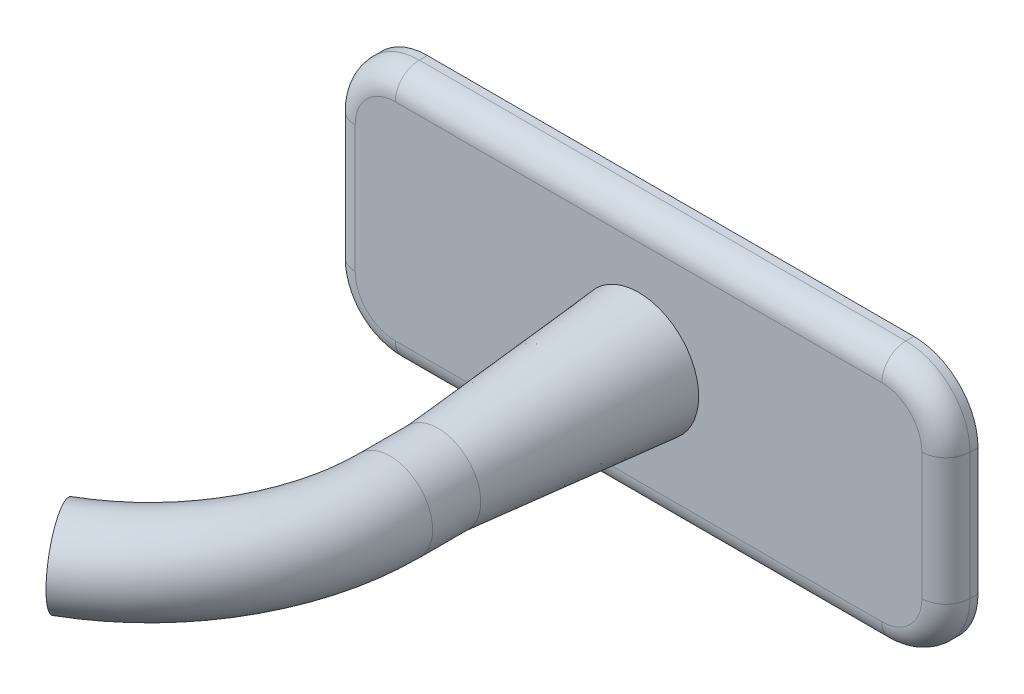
ISO-10303-21;
HEADER;
FILE_DESCRIPTION(('STEP AP214'),'2;1');
FILE_NAME('part.step','',(''),(''),'','','');
FILE_SCHEMA(('AUTOMOTIVE_DESIGN { 1 0 10303 214 1 1 1 1 }'));
ENDSEC;
DATA;
#1=APPLICATION_CONTEXT('core data for automotive mechanical design processes');
#2=APPLICATION_PROTOCOL_DEFINITION('international standard','automotive_design',2000,#1);
#3=PRODUCT_CONTEXT('',#1,'mechanical');
#4=PRODUCT('Part','Part','',(#3));
#5=PRODUCT_RELATED_PRODUCT_CATEGORY('part','',(#4));
#6=PRODUCT_DEFINITION_FORMATION('','',#4);
#7=PRODUCT_DEFINITION_CONTEXT('part definition',#1,'design');
#8=PRODUCT_DEFINITION('design','',#6,#7);
#9=PRODUCT_DEFINITION_SHAPE('','',#8);
#10=(LENGTH_UNIT() NAMED_UNIT(*) SI_UNIT(.MILLI.,.METRE.));
#11=(NAMED_UNIT(*) PLANE_ANGLE_UNIT() SI_UNIT($,.RADIAN.));
#12=(NAMED_UNIT(*) SI_UNIT($,.STERADIAN.) SOLID_ANGLE_UNIT());
#13=UNCERTAINTY_MEASURE_WITH_UNIT(LENGTH_MEASURE(1.E-05),#10,'distance_accuracy_value','');
#14=(GEOMETRIC_REPRESENTATION_CONTEXT(3) GLOBAL_UNCERTAINTY_ASSIGNED_CONTEXT((#13)) GLOBAL_UNIT_ASSIGNED_CONTEXT((#10,
#11,#12)) REPRESENTATION_CONTEXT('',''));
#15=CARTESIAN_POINT('',(0.,0.,0.));
#16=DIRECTION('',(0.,0.,1.));
#17=DIRECTION('',(1.,0.,0.));
#18=AXIS2_PLACEMENT_3D('',#15,#16,#17);
#19=CARTESIAN_POINT('',(-9.740999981,-4.04241,1.016));
#20=DIRECTION('',(0.,0.,1.));
#21=DIRECTION('',(1.,0.,0.));
#22=AXIS2_PLACEMENT_3D('',#19,#20,#21);
#23=PLANE('',#22);
#24=DIRECTION('',(0.,-1.,0.));
#25=VECTOR('',#24,1.);
#26=CARTESIAN_POINT('',(-8.978999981,-2.01041,1.016));
#27=LINE('',#26,#25);
#28=CARTESIAN_POINT('',(-8.978999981,2.01041,1.016));
#29=VERTEX_POINT('',#28);
#30=CARTESIAN_POINT('',(-8.978999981,-2.01041,1.016));
#31=VERTEX_POINT('',#30);
#32=EDGE_CURVE('E196',#29,#31,#27,.T.);
#33=ORIENTED_EDGE('',*,*,#32,.T.);
#34=CARTESIAN_POINT('',(-7.708999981,-2.01041,1.016));
#35=DIRECTION('',(0.,0.,1.));
#36=DIRECTION('',(1.,0.,0.));
#37=AXIS2_PLACEMENT_3D('',#34,#35,#36);
#38=CIRCLE('',#37,1.27);
#39=CARTESIAN_POINT('',(-7.708999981,-3.28041,1.016));
#40=VERTEX_POINT('',#39);
#41=EDGE_CURVE('E198',#31,#40,#38,.T.);
#42=ORIENTED_EDGE('',*,*,#41,.T.);
#43=DIRECTION('',(1.,0.,0.));
#44=VECTOR('',#43,1.);
#45=CARTESIAN_POINT('',(7.708999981,-3.28041,1.016));
#46=LINE('',#45,#44);
#47=CARTESIAN_POINT('',(7.708999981,-3.28041,1.016));
#48=VERTEX_POINT('',#47);
#49=EDGE_CURVE('E184',#40,#48,#46,.T.);
#50=ORIENTED_EDGE('',*,*,#49,.T.);
#51=CARTESIAN_POINT('',(7.708999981,-2.01041,1.016));
#52=DIRECTION('',(0.,0.,1.));
#53=DIRECTION('',(1.,0.,0.));
#54=AXIS2_PLACEMENT_3D('',#51,#52,#53);
#55=CIRCLE('',#54,1.27);
#56=CARTESIAN_POINT('',(8.978999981,-2.01041,1.016));
#57=VERTEX_POINT('',#56);
#58=EDGE_CURVE('E186',#48,#57,#55,.T.);
#59=ORIENTED_EDGE('',*,*,#58,.T.);
#60=DIRECTION('',(0.,1.,0.));
#61=VECTOR('',#60,1.);
#62=CARTESIAN_POINT('',(8.978999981,2.01041,1.016));
#63=LINE('',#62,#61);
#64=CARTESIAN_POINT('',(8.978999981,2.01041,1.016));
#65=VERTEX_POINT('',#64);
#66=EDGE_CURVE('E188',#57,#65,#63,.T.);
#67=ORIENTED_EDGE('',*,*,#66,.T.);
#68=CARTESIAN_POINT('',(7.708999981,2.01041,1.016));
#69=DIRECTION('',(0.,0.,1.));
#70=DIRECTION('',(1.,0.,0.));
#71=AXIS2_PLACEMENT_3D('',#68,#69,#70);
#72=CIRCLE('',#71,1.27);
#73=CARTESIAN_POINT('',(7.708999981,3.28041,1.016));
#74=VERTEX_POINT('',#73);
#75=EDGE_CURVE('E190',#65,#74,#72,.T.);
#76=ORIENTED_EDGE('',*,*,#75,.T.);
#77=DIRECTION('',(-1.,0.,0.));
#78=VECTOR('',#77,1.);
#79=CARTESIAN_POINT('',(-7.708999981,3.28041,1.016));
#80=LINE('',#79,#78);
#81=CARTESIAN_POINT('',(-7.708999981,3.28041,1.016));
#82=VERTEX_POINT('',#81);
#83=EDGE_CURVE('E192',#74,#82,#80,.T.);
#84=ORIENTED_EDGE('',*,*,#83,.T.);
#85=CARTESIAN_POINT('',(-7.708999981,2.01041,1.016));
#86=DIRECTION('',(0.,0.,1.));
#87=DIRECTION('',(1.,0.,0.));
#88=AXIS2_PLACEMENT_3D('',#85,#86,#87);
#89=CIRCLE('',#88,1.27);
#90=EDGE_CURVE('E194',#82,#29,#89,.T.);
#91=ORIENTED_EDGE('',*,*,#90,.T.);
#92=EDGE_LOOP('',(#33,#42,#50,#59,#67,#76,#84,#91));
#93=FACE_BOUND('',#92,.T.);
#94=CARTESIAN_POINT('',(0.,0.,1.016));
#95=DIRECTION('',(0.,0.,1.));
#96=DIRECTION('',(1.,0.,0.));
#97=AXIS2_PLACEMENT_3D('',#94,#95,#96);
#98=CIRCLE('',#97,1.905);
#99=CARTESIAN_POINT('',(1.905,0.,1.016));
#100=VERTEX_POINT('',#99);
#101=EDGE_CURVE('E474',#100,#100,#98,.T.);
#102=ORIENTED_EDGE('',*,*,#101,.F.);
#103=EDGE_LOOP('',(#102));
#104=FACE_BOUND('',#103,.T.);
#105=ADVANCED_FACE('F35',(#93,#104),#23,.T.);
#106=CARTESIAN_POINT('',(-9.740999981,4.04241,1.016));
#107=DIRECTION('',(1.,0.,0.));
#108=DIRECTION('',(0.,0.,-1.));
#109=AXIS2_PLACEMENT_3D('',#106,#107,#108);
#110=PLANE('',#109);
#111=DIRECTION('',(0.,0.,-1.));
#112=VECTOR('',#111,1.);
#113=CARTESIAN_POINT('',(-9.740999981,-2.01041,1.016));
#114=LINE('',#113,#112);
#115=CARTESIAN_POINT('',(-9.740999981,-2.01041,0.));
#116=VERTEX_POINT('',#115);
#117=CARTESIAN_POINT('',(-9.740999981,-2.01041,0.254));
#118=VERTEX_POINT('',#117);
#119=EDGE_CURVE('E138',#116,#118,#114,.F.);
#120=ORIENTED_EDGE('',*,*,#119,.T.);
#121=DIRECTION('',(0.,-1.,0.));
#122=VECTOR('',#121,1.);
#123=CARTESIAN_POINT('',(-9.740999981,2.01041,0.254));
#124=LINE('',#123,#122);
#125=CARTESIAN_POINT('',(-9.740999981,2.01041,0.254));
#126=VERTEX_POINT('',#125);
#127=EDGE_CURVE('E134',#118,#126,#124,.F.);
#128=ORIENTED_EDGE('',*,*,#127,.T.);
#129=DIRECTION('',(0.,0.,-1.));
#130=VECTOR('',#129,1.);
#131=CARTESIAN_POINT('',(-9.740999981,2.01041,1.016));
#132=LINE('',#131,#130);
#133=CARTESIAN_POINT('',(-9.740999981,2.01041,0.));
#134=VERTEX_POINT('',#133);
#135=EDGE_CURVE('E126',#126,#134,#132,.T.);
#136=ORIENTED_EDGE('',*,*,#135,.T.);
#137=DIRECTION('',(0.,-1.,0.));
#138=VECTOR('',#137,1.);
#139=CARTESIAN_POINT('',(-9.740999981,4.04241,0.));
#140=LINE('',#139,#138);
#141=EDGE_CURVE('E131',#134,#116,#140,.T.);
#142=ORIENTED_EDGE('',*,*,#141,.T.);
#143=EDGE_LOOP('',(#120,#128,#136,#142));
#144=FACE_BOUND('',#143,.T.);
#145=ADVANCED_FACE('F129',(#144),#110,.F.);
#146=CARTESIAN_POINT('',(-9.740999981,-4.04241,1.016));
#147=DIRECTION('',(0.,1.,0.));
#148=DIRECTION('',(0.,0.,1.));
#149=AXIS2_PLACEMENT_3D('',#146,#147,#148);
#150=PLANE('',#149);
#151=DIRECTION('',(0.,0.,-1.));
#152=VECTOR('',#151,1.);
#153=CARTESIAN_POINT('',(7.708999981,-4.04241,1.016));
#154=LINE('',#153,#152);
#155=CARTESIAN_POINT('',(7.708999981,-4.04241,0.));
#156=VERTEX_POINT('',#155);
#157=CARTESIAN_POINT('',(7.708999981,-4.04241,0.254));
#158=VERTEX_POINT('',#157);
#159=EDGE_CURVE('E176',#156,#158,#154,.F.);
#160=ORIENTED_EDGE('',*,*,#159,.T.);
#161=DIRECTION('',(1.,0.,0.));
#162=VECTOR('',#161,1.);
#163=CARTESIAN_POINT('',(-7.708999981,-4.04241,0.254));
#164=LINE('',#163,#162);
#165=CARTESIAN_POINT('',(-7.708999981,-4.04241,0.254));
#166=VERTEX_POINT('',#165);
#167=EDGE_CURVE('E11',#158,#166,#164,.F.);
#168=ORIENTED_EDGE('',*,*,#167,.T.);
#169=DIRECTION('',(0.,0.,-1.));
#170=VECTOR('',#169,1.);
#171=CARTESIAN_POINT('',(-7.708999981,-4.04241,1.016));
#172=LINE('',#171,#170);
#173=CARTESIAN_POINT('',(-7.708999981,-4.04241,0.));
#174=VERTEX_POINT('',#173);
#175=EDGE_CURVE('E178',#166,#174,#172,.T.);
#176=ORIENTED_EDGE('',*,*,#175,.T.);
#177=DIRECTION('',(1.,0.,0.));
#178=VECTOR('',#177,1.);
#179=CARTESIAN_POINT('',(-9.740999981,-4.04241,0.));
#180=LINE('',#179,#178);
#181=EDGE_CURVE('E154',#174,#156,#180,.T.);
#182=ORIENTED_EDGE('',*,*,#181,.T.);
#183=EDGE_LOOP('',(#160,#168,#176,#182));
#184=FACE_BOUND('',#183,.T.);
#185=ADVANCED_FACE('F253',(#184),#150,.F.);
#186=CARTESIAN_POINT('',(9.740999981,4.04241,1.016));
#187=DIRECTION('',(-1.,0.,0.));
#188=DIRECTION('',(0.,-1.,0.));
#189=AXIS2_PLACEMENT_3D('',#186,#187,#188);
#190=PLANE('',#189);
#191=DIRECTION('',(0.,0.,-1.));
#192=VECTOR('',#191,1.);
#193=CARTESIAN_POINT('',(9.740999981,2.01041,1.016));
#194=LINE('',#193,#192);
#195=CARTESIAN_POINT('',(9.740999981,2.01041,0.));
#196=VERTEX_POINT('',#195);
#197=CARTESIAN_POINT('',(9.740999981,2.01041,0.254));
#198=VERTEX_POINT('',#197);
#199=EDGE_CURVE('E182',#196,#198,#194,.F.);
#200=ORIENTED_EDGE('',*,*,#199,.T.);
#201=DIRECTION('',(0.,1.,0.));
#202=VECTOR('',#201,1.);
#203=CARTESIAN_POINT('',(9.740999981,-2.01041,0.254));
#204=LINE('',#203,#202);
#205=CARTESIAN_POINT('',(9.740999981,-2.01041,0.254));
#206=VERTEX_POINT('',#205);
#207=EDGE_CURVE('E59',#198,#206,#204,.F.);
#208=ORIENTED_EDGE('',*,*,#207,.T.);
#209=DIRECTION('',(0.,0.,-1.));
#210=VECTOR('',#209,1.);
#211=CARTESIAN_POINT('',(9.740999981,-2.01041,1.016));
#212=LINE('',#211,#210);
#213=CARTESIAN_POINT('',(9.740999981,-2.01041,0.));
#214=VERTEX_POINT('',#213);
#215=EDGE_CURVE('E180',#206,#214,#212,.T.);
#216=ORIENTED_EDGE('',*,*,#215,.T.);
#217=DIRECTION('',(0.,1.,0.));
#218=VECTOR('',#217,1.);
#219=CARTESIAN_POINT('',(9.740999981,4.04241,0.));
#220=LINE('',#219,#218);
#221=EDGE_CURVE('E157',#214,#196,#220,.T.);
#222=ORIENTED_EDGE('',*,*,#221,.T.);
#223=EDGE_LOOP('',(#200,#208,#216,#222));
#224=FACE_BOUND('',#223,.T.);
#225=ADVANCED_FACE('F295',(#224),#190,.F.);
#226=CARTESIAN_POINT('',(-9.740999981,4.04241,1.016));
#227=DIRECTION('',(0.,-1.,0.));
#228=DIRECTION('',(0.,0.,-1.));
#229=AXIS2_PLACEMENT_3D('',#226,#227,#228);
#230=PLANE('',#229);
#231=DIRECTION('',(0.,0.,-1.));
#232=VECTOR('',#231,1.);
#233=CARTESIAN_POINT('',(-7.708999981,4.04241,1.016));
#234=LINE('',#233,#232);
#235=CARTESIAN_POINT('',(-7.708999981,4.04241,0.));
#236=VERTEX_POINT('',#235);
#237=CARTESIAN_POINT('',(-7.708999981,4.04241,0.254));
#238=VERTEX_POINT('',#237);
#239=EDGE_CURVE('E144',#236,#238,#234,.F.);
#240=ORIENTED_EDGE('',*,*,#239,.T.);
#241=DIRECTION('',(-1.,0.,0.));
#242=VECTOR('',#241,1.);
#243=CARTESIAN_POINT('',(7.708999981,4.04241,0.254));
#244=LINE('',#243,#242);
#245=CARTESIAN_POINT('',(7.708999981,4.04241,0.254));
#246=VERTEX_POINT('',#245);
#247=EDGE_CURVE('E207',#238,#246,#244,.F.);
#248=ORIENTED_EDGE('',*,*,#247,.T.);
#249=DIRECTION('',(0.,0.,-1.));
#250=VECTOR('',#249,1.);
#251=CARTESIAN_POINT('',(7.708999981,4.04241,1.016));
#252=LINE('',#251,#250);
#253=CARTESIAN_POINT('',(7.708999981,4.04241,0.));
#254=VERTEX_POINT('',#253);
#255=EDGE_CURVE('E148',#246,#254,#252,.T.);
#256=ORIENTED_EDGE('',*,*,#255,.T.);
#257=DIRECTION('',(-1.,0.,0.));
#258=VECTOR('',#257,1.);
#259=CARTESIAN_POINT('',(-9.740999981,4.04241,0.));
#260=LINE('',#259,#258);
#261=EDGE_CURVE('E167',#254,#236,#260,.T.);
#262=ORIENTED_EDGE('',*,*,#261,.T.);
#263=EDGE_LOOP('',(#240,#248,#256,#262));
#264=FACE_BOUND('',#263,.T.);
#265=ADVANCED_FACE('F270',(#264),#230,.F.);
#266=CARTESIAN_POINT('',(-9.740999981,-4.04241,0.));
#267=DIRECTION('',(0.,0.,1.));
#268=DIRECTION('',(1.,0.,0.));
#269=AXIS2_PLACEMENT_3D('',#266,#267,#268);
#270=PLANE('',#269);
#271=ORIENTED_EDGE('',*,*,#141,.F.);
#272=CARTESIAN_POINT('',(-7.708999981,2.01041,0.));
#273=DIRECTION('',(0.,0.,1.));
#274=DIRECTION('',(1.,0.,0.));
#275=AXIS2_PLACEMENT_3D('',#272,#273,#274);
#276=CIRCLE('',#275,2.032);
#277=EDGE_CURVE('E141',#134,#236,#276,.F.);
#278=ORIENTED_EDGE('',*,*,#277,.T.);
#279=ORIENTED_EDGE('',*,*,#261,.F.);
#280=CARTESIAN_POINT('',(7.708999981,2.01041,0.));
#281=DIRECTION('',(0.,0.,1.));
#282=DIRECTION('',(1.,0.,0.));
#283=AXIS2_PLACEMENT_3D('',#280,#281,#282);
#284=CIRCLE('',#283,2.032);
#285=EDGE_CURVE('E171',#254,#196,#284,.F.);
#286=ORIENTED_EDGE('',*,*,#285,.T.);
#287=ORIENTED_EDGE('',*,*,#221,.F.);
#288=CARTESIAN_POINT('',(7.708999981,-2.01041,0.));
#289=DIRECTION('',(0.,0.,1.));
#290=DIRECTION('',(1.,0.,0.));
#291=AXIS2_PLACEMENT_3D('',#288,#289,#290);
#292=CIRCLE('',#291,2.032);
#293=EDGE_CURVE('E137',#214,#156,#292,.F.);
#294=ORIENTED_EDGE('',*,*,#293,.T.);
#295=ORIENTED_EDGE('',*,*,#181,.F.);
#296=CARTESIAN_POINT('',(-7.708999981,-2.01041,0.));
#297=DIRECTION('',(0.,0.,1.));
#298=DIRECTION('',(1.,0.,0.));
#299=AXIS2_PLACEMENT_3D('',#296,#297,#298);
#300=CIRCLE('',#299,2.032);
#301=EDGE_CURVE('E149',#174,#116,#300,.F.);
#302=ORIENTED_EDGE('',*,*,#301,.T.);
#303=EDGE_LOOP('',(#271,#278,#279,#286,#287,#294,#295,#302));
#304=FACE_BOUND('',#303,.T.);
#305=ADVANCED_FACE('F151',(#304),#270,.F.);
#306=CARTESIAN_POINT('',(-7.708999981,2.01041,1.016));
#307=DIRECTION('',(0.,0.,-1.));
#308=DIRECTION('',(-1.,0.,0.));
#309=AXIS2_PLACEMENT_3D('',#306,#307,#308);
#310=CYLINDRICAL_SURFACE('',#309,2.032);
#311=ORIENTED_EDGE('',*,*,#135,.F.);
#312=CARTESIAN_POINT('',(-7.708999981,2.01041,0.254));
#313=DIRECTION('',(0.,0.,1.));
#314=DIRECTION('',(1.,0.,0.));
#315=AXIS2_PLACEMENT_3D('',#312,#313,#314);
#316=CIRCLE('',#315,2.032);
#317=EDGE_CURVE('E205',#126,#238,#316,.F.);
#318=ORIENTED_EDGE('',*,*,#317,.T.);
#319=ORIENTED_EDGE('',*,*,#239,.F.);
#320=ORIENTED_EDGE('',*,*,#277,.F.);
#321=EDGE_LOOP('',(#311,#318,#319,#320));
#322=FACE_BOUND('',#321,.T.);
#323=ADVANCED_FACE('F142',(#322),#310,.T.);
#324=CARTESIAN_POINT('',(-7.708999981,-2.01041,1.016));
#325=DIRECTION('',(0.,0.,-1.));
#326=DIRECTION('',(-1.,0.,0.));
#327=AXIS2_PLACEMENT_3D('',#324,#325,#326);
#328=CYLINDRICAL_SURFACE('',#327,2.032);
#329=ORIENTED_EDGE('',*,*,#175,.F.);
#330=CARTESIAN_POINT('',(-7.708999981,-2.01041,0.254));
#331=DIRECTION('',(0.,0.,1.));
#332=DIRECTION('',(1.,0.,0.));
#333=AXIS2_PLACEMENT_3D('',#330,#331,#332);
#334=CIRCLE('',#333,2.032);
#335=EDGE_CURVE('E201',#166,#118,#334,.F.);
#336=ORIENTED_EDGE('',*,*,#335,.T.);
#337=ORIENTED_EDGE('',*,*,#119,.F.);
#338=ORIENTED_EDGE('',*,*,#301,.F.);
#339=EDGE_LOOP('',(#329,#336,#337,#338));
#340=FACE_BOUND('',#339,.T.);
#341=ADVANCED_FACE('F256',(#340),#328,.T.);
#342=CARTESIAN_POINT('',(7.708999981,2.01041,1.016));
#343=DIRECTION('',(0.,0.,-1.));
#344=DIRECTION('',(-1.,0.,0.));
#345=AXIS2_PLACEMENT_3D('',#342,#343,#344);
#346=CYLINDRICAL_SURFACE('',#345,2.032);
#347=ORIENTED_EDGE('',*,*,#255,.F.);
#348=CARTESIAN_POINT('',(7.708999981,2.01041,0.254));
#349=DIRECTION('',(0.,0.,1.));
#350=DIRECTION('',(1.,0.,0.));
#351=AXIS2_PLACEMENT_3D('',#348,#349,#350);
#352=CIRCLE('',#351,2.032);
#353=EDGE_CURVE('E209',#246,#198,#352,.F.);
#354=ORIENTED_EDGE('',*,*,#353,.T.);
#355=ORIENTED_EDGE('',*,*,#199,.F.);
#356=ORIENTED_EDGE('',*,*,#285,.F.);
#357=EDGE_LOOP('',(#347,#354,#355,#356));
#358=FACE_BOUND('',#357,.T.);
#359=ADVANCED_FACE('F304',(#358),#346,.T.);
#360=CARTESIAN_POINT('',(7.708999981,-2.01041,1.016));
#361=DIRECTION('',(0.,0.,-1.));
#362=DIRECTION('',(-1.,0.,0.));
#363=AXIS2_PLACEMENT_3D('',#360,#361,#362);
#364=CYLINDRICAL_SURFACE('',#363,2.032);
#365=ORIENTED_EDGE('',*,*,#215,.F.);
#366=CARTESIAN_POINT('',(7.708999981,-2.01041,0.254));
#367=DIRECTION('',(0.,0.,1.));
#368=DIRECTION('',(1.,0.,0.));
#369=AXIS2_PLACEMENT_3D('',#366,#367,#368);
#370=CIRCLE('',#369,2.032);
#371=EDGE_CURVE('E44',#206,#158,#370,.F.);
#372=ORIENTED_EDGE('',*,*,#371,.T.);
#373=ORIENTED_EDGE('',*,*,#159,.F.);
#374=ORIENTED_EDGE('',*,*,#293,.F.);
#375=EDGE_LOOP('',(#365,#372,#373,#374));
#376=FACE_BOUND('',#375,.T.);
#377=ADVANCED_FACE('F280',(#376),#364,.T.);
#378=CARTESIAN_POINT('',(7.708999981,2.01041,0.254));
#379=DIRECTION('',(0.,0.,1.));
#380=DIRECTION('',(1.,0.,0.));
#381=AXIS2_PLACEMENT_3D('',#378,#379,#380);
#382=TOROIDAL_SURFACE('',#381,1.27,0.762);
#383=CARTESIAN_POINT('',(8.978999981,2.01041,0.254));
#384=DIRECTION('',(0.,-1.,0.));
#385=DIRECTION('',(0.,0.,-1.));
#386=AXIS2_PLACEMENT_3D('',#383,#384,#385);
#387=CIRCLE('',#386,0.762);
#388=EDGE_CURVE('E160',#198,#65,#387,.T.);
#389=ORIENTED_EDGE('',*,*,#388,.F.);
#390=ORIENTED_EDGE('',*,*,#353,.F.);
#391=CARTESIAN_POINT('',(7.708999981,3.28041,0.254));
#392=DIRECTION('',(-1.,0.,0.));
#393=DIRECTION('',(0.,0.,1.));
#394=AXIS2_PLACEMENT_3D('',#391,#392,#393);
#395=CIRCLE('',#394,0.762);
#396=EDGE_CURVE('E39',#74,#246,#395,.T.);
#397=ORIENTED_EDGE('',*,*,#396,.F.);
#398=ORIENTED_EDGE('',*,*,#75,.F.);
#399=EDGE_LOOP('',(#389,#390,#397,#398));
#400=FACE_BOUND('',#399,.T.);
#401=ADVANCED_FACE('F37',(#400),#382,.T.);
#402=CARTESIAN_POINT('',(-9.740999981,3.28041,0.254));
#403=DIRECTION('',(1.,0.,0.));
#404=DIRECTION('',(0.,0.,-1.));
#405=AXIS2_PLACEMENT_3D('',#402,#403,#404);
#406=CYLINDRICAL_SURFACE('',#405,0.762);
#407=ORIENTED_EDGE('',*,*,#396,.T.);
#408=ORIENTED_EDGE('',*,*,#247,.F.);
#409=CARTESIAN_POINT('',(-7.708999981,3.28041,0.254));
#410=DIRECTION('',(-1.,0.,0.));
#411=DIRECTION('',(0.,0.,1.));
#412=AXIS2_PLACEMENT_3D('',#409,#410,#411);
#413=CIRCLE('',#412,0.762);
#414=EDGE_CURVE('E226',#82,#238,#413,.T.);
#415=ORIENTED_EDGE('',*,*,#414,.F.);
#416=ORIENTED_EDGE('',*,*,#83,.F.);
#417=EDGE_LOOP('',(#407,#408,#415,#416));
#418=FACE_BOUND('',#417,.T.);
#419=ADVANCED_FACE('F273',(#418),#406,.T.);
#420=CARTESIAN_POINT('',(8.978999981,-4.04241,0.254));
#421=DIRECTION('',(0.,-1.,0.));
#422=DIRECTION('',(1.,0.,0.));
#423=AXIS2_PLACEMENT_3D('',#420,#421,#422);
#424=CYLINDRICAL_SURFACE('',#423,0.762);
#425=ORIENTED_EDGE('',*,*,#388,.T.);
#426=ORIENTED_EDGE('',*,*,#66,.F.);
#427=CARTESIAN_POINT('',(8.978999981,-2.01041,0.254));
#428=DIRECTION('',(0.,-1.,0.));
#429=DIRECTION('',(0.,0.,-1.));
#430=AXIS2_PLACEMENT_3D('',#427,#428,#429);
#431=CIRCLE('',#430,0.762);
#432=EDGE_CURVE('E223',#206,#57,#431,.T.);
#433=ORIENTED_EDGE('',*,*,#432,.F.);
#434=ORIENTED_EDGE('',*,*,#207,.F.);
#435=EDGE_LOOP('',(#425,#426,#433,#434));
#436=FACE_BOUND('',#435,.T.);
#437=ADVANCED_FACE('F232',(#436),#424,.T.);
#438=CARTESIAN_POINT('',(-7.708999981,2.01041,0.254));
#439=DIRECTION('',(0.,0.,1.));
#440=DIRECTION('',(1.,0.,0.));
#441=AXIS2_PLACEMENT_3D('',#438,#439,#440);
#442=TOROIDAL_SURFACE('',#441,1.27,0.762);
#443=ORIENTED_EDGE('',*,*,#414,.T.);
#444=ORIENTED_EDGE('',*,*,#317,.F.);
#445=CARTESIAN_POINT('',(-8.978999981,2.01041,0.254));
#446=DIRECTION('',(0.,-1.,0.));
#447=DIRECTION('',(0.,0.,-1.));
#448=AXIS2_PLACEMENT_3D('',#445,#446,#447);
#449=CIRCLE('',#448,0.762);
#450=EDGE_CURVE('E220',#29,#126,#449,.T.);
#451=ORIENTED_EDGE('',*,*,#450,.F.);
#452=ORIENTED_EDGE('',*,*,#90,.F.);
#453=EDGE_LOOP('',(#443,#444,#451,#452));
#454=FACE_BOUND('',#453,.T.);
#455=ADVANCED_FACE('F267',(#454),#442,.T.);
#456=CARTESIAN_POINT('',(7.708999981,-2.01041,0.254));
#457=DIRECTION('',(0.,0.,1.));
#458=DIRECTION('',(1.,0.,0.));
#459=AXIS2_PLACEMENT_3D('',#456,#457,#458);
#460=TOROIDAL_SURFACE('',#459,1.27,0.762);
#461=ORIENTED_EDGE('',*,*,#432,.T.);
#462=ORIENTED_EDGE('',*,*,#58,.F.);
#463=CARTESIAN_POINT('',(7.708999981,-3.28041,0.254));
#464=DIRECTION('',(-1.,0.,0.));
#465=DIRECTION('',(0.,-1.,0.));
#466=AXIS2_PLACEMENT_3D('',#463,#464,#465);
#467=CIRCLE('',#466,0.762);
#468=EDGE_CURVE('E217',#158,#48,#467,.T.);
#469=ORIENTED_EDGE('',*,*,#468,.F.);
#470=ORIENTED_EDGE('',*,*,#371,.F.);
#471=EDGE_LOOP('',(#461,#462,#469,#470));
#472=FACE_BOUND('',#471,.T.);
#473=ADVANCED_FACE('F246',(#472),#460,.T.);
#474=CARTESIAN_POINT('',(-8.978999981,-4.04241,0.254));
#475=DIRECTION('',(0.,1.,0.));
#476=DIRECTION('',(0.,0.,1.));
#477=AXIS2_PLACEMENT_3D('',#474,#475,#476);
#478=CYLINDRICAL_SURFACE('',#477,0.762);
#479=ORIENTED_EDGE('',*,*,#450,.T.);
#480=ORIENTED_EDGE('',*,*,#127,.F.);
#481=CARTESIAN_POINT('',(-8.978999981,-2.01041,0.254));
#482=DIRECTION('',(0.,-1.,0.));
#483=DIRECTION('',(0.,0.,-1.));
#484=AXIS2_PLACEMENT_3D('',#481,#482,#483);
#485=CIRCLE('',#484,0.762);
#486=EDGE_CURVE('E215',#31,#118,#485,.T.);
#487=ORIENTED_EDGE('',*,*,#486,.F.);
#488=ORIENTED_EDGE('',*,*,#32,.F.);
#489=EDGE_LOOP('',(#479,#480,#487,#488));
#490=FACE_BOUND('',#489,.T.);
#491=ADVANCED_FACE('F263',(#490),#478,.T.);
#492=CARTESIAN_POINT('',(-9.740999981,-3.28041,0.254));
#493=DIRECTION('',(-1.,0.,0.));
#494=DIRECTION('',(0.,0.,1.));
#495=AXIS2_PLACEMENT_3D('',#492,#493,#494);
#496=CYLINDRICAL_SURFACE('',#495,0.762);
#497=ORIENTED_EDGE('',*,*,#468,.T.);
#498=ORIENTED_EDGE('',*,*,#49,.F.);
#499=CARTESIAN_POINT('',(-7.708999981,-3.28041,0.254));
#500=DIRECTION('',(-1.,0.,0.));
#501=DIRECTION('',(0.,0.,1.));
#502=AXIS2_PLACEMENT_3D('',#499,#500,#501);
#503=CIRCLE('',#502,0.762);
#504=EDGE_CURVE('E213',#166,#40,#503,.T.);
#505=ORIENTED_EDGE('',*,*,#504,.F.);
#506=ORIENTED_EDGE('',*,*,#167,.F.);
#507=EDGE_LOOP('',(#497,#498,#505,#506));
#508=FACE_BOUND('',#507,.T.);
#509=ADVANCED_FACE('F249',(#508),#496,.T.);
#510=CARTESIAN_POINT('',(-7.708999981,-2.01041,0.254));
#511=DIRECTION('',(0.,0.,1.));
#512=DIRECTION('',(1.,0.,0.));
#513=AXIS2_PLACEMENT_3D('',#510,#511,#512);
#514=TOROIDAL_SURFACE('',#513,1.27,0.762);
#515=ORIENTED_EDGE('',*,*,#486,.T.);
#516=ORIENTED_EDGE('',*,*,#335,.F.);
#517=ORIENTED_EDGE('',*,*,#504,.T.);
#518=ORIENTED_EDGE('',*,*,#41,.F.);
#519=EDGE_LOOP('',(#515,#516,#517,#518));
#520=FACE_BOUND('',#519,.T.);
#521=ADVANCED_FACE('F258',(#520),#514,.T.);
#522=CARTESIAN_POINT('',(0.,0.,1.016));
#523=DIRECTION('',(0.,0.,-1.));
#524=DIRECTION('',(1.,0.,0.));
#525=AXIS2_PLACEMENT_3D('',#522,#523,#524);
#526=CONICAL_SURFACE('',#525,1.905,0.0872664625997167);
#527=CARTESIAN_POINT('',(0.,0.,7.366));
#528=DIRECTION('',(0.,0.,1.));
#529=DIRECTION('',(1.,0.,0.));
#530=AXIS2_PLACEMENT_3D('',#527,#528,#529);
#531=CIRCLE('',#530,1.34944698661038);
#532=CARTESIAN_POINT('',(1.34944698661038,0.,7.366));
#533=VERTEX_POINT('',#532);
#534=EDGE_CURVE('E162',#533,#533,#531,.T.);
#535=ORIENTED_EDGE('',*,*,#534,.F.);
#536=EDGE_LOOP('',(#535));
#537=FACE_BOUND('',#536,.T.);
#538=ORIENTED_EDGE('',*,*,#101,.T.);
#539=EDGE_LOOP('',(#538));
#540=FACE_BOUND('',#539,.T.);
#541=ADVANCED_FACE('F289',(#537,#540),#526,.T.);
#542=CARTESIAN_POINT('',(0.,0.,8.89));
#543=DIRECTION('',(0.,0.,-1.));
#544=DIRECTION('',(-1.,0.,0.));
#545=AXIS2_PLACEMENT_3D('',#542,#543,#544);
#546=CYLINDRICAL_SURFACE('',#545,1.34944698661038);
#547=CARTESIAN_POINT('',(0.,0.,8.89));
#548=DIRECTION('',(0.,0.,1.));
#549=DIRECTION('',(1.,0.,0.));
#550=AXIS2_PLACEMENT_3D('',#547,#548,#549);
#551=CIRCLE('',#550,1.34944698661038);
#552=CARTESIAN_POINT('',(1.34944698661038,0.,8.89));
#553=VERTEX_POINT('',#552);
#554=EDGE_CURVE('E471',#553,#553,#551,.T.);
#555=ORIENTED_EDGE('',*,*,#554,.F.);
#556=EDGE_LOOP('',(#555));
#557=FACE_BOUND('',#556,.T.);
#558=ORIENTED_EDGE('',*,*,#534,.T.);
#559=EDGE_LOOP('',(#558));
#560=FACE_BOUND('',#559,.T.);
#561=ADVANCED_FACE('F345',(#557,#560),#546,.T.);
#562=CARTESIAN_POINT('',(-7.62,0.,8.89));
#563=DIRECTION('',(0.,1.,0.));
#564=DIRECTION('',(0.,0.,1.));
#565=AXIS2_PLACEMENT_3D('',#562,#563,#564);
#566=TOROIDAL_SURFACE('',#565,7.62,1.34944698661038);
#567=CARTESIAN_POINT('',(-3.81000000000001,0.,15.4891135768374));
#568=DIRECTION('',(-0.86602540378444,0.,0.499999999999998));
#569=DIRECTION('',(0.499999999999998,0.,0.86602540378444));
#570=AXIS2_PLACEMENT_3D('',#567,#568,#569);
#571=CIRCLE('',#570,1.34944698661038);
#572=CARTESIAN_POINT('',(-3.13527650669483,0.,16.6577689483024));
#573=VERTEX_POINT('',#572);
#574=EDGE_CURVE('E470',#573,#573,#571,.T.);
#575=CARTESIAN_POINT('',(-7.62,0.,8.89));
#576=DIRECTION('',(0.,1.,0.));
#577=DIRECTION('',(0.,0.,1.));
#578=AXIS2_PLACEMENT_3D('',#575,#576,#577);
#579=CIRCLE('',#578,8.96944698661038);
#580=EDGE_CURVE('',#573,#553,#579,.T.);
#581=ORIENTED_EDGE('',*,*,#574,.F.);
#582=ORIENTED_EDGE('',*,*,#554,.T.);
#583=ORIENTED_EDGE('',*,*,#580,.T.);
#584=ORIENTED_EDGE('',*,*,#580,.F.);
#585=EDGE_LOOP('',(#581,#583,#582,#584));
#586=FACE_BOUND('',#585,.T.);
#587=ADVANCED_FACE('F352',(#586),#566,.T.);
#588=CARTESIAN_POINT('',(-3.81000000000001,0.,15.4891135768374));
#589=DIRECTION('',(-0.86602540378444,0.,0.499999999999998));
#590=DIRECTION('',(0.499999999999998,0.,0.86602540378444));
#591=AXIS2_PLACEMENT_3D('',#588,#589,#590);
#592=PLANE('',#591);
#593=ORIENTED_EDGE('',*,*,#574,.T.);
#594=EDGE_LOOP('',(#593));
#595=FACE_BOUND('',#594,.T.);
#596=ADVANCED_FACE('F354',(#595),#592,.T.);
#597=CLOSED_SHELL('',(#105,#145,#185,#225,#265,#305,#323,#341,#359,#377,#401,#419,#437,#455,
#473,#491,#509,#521,#541,#561,#587,#596));
#598=MANIFOLD_SOLID_BREP('B2',#597);
#599=ADVANCED_BREP_SHAPE_REPRESENTATION('',(#18,#598),#14);
#600=SHAPE_DEFINITION_REPRESENTATION(#9,#599);
ENDSEC;
END-ISO-10303-21;
